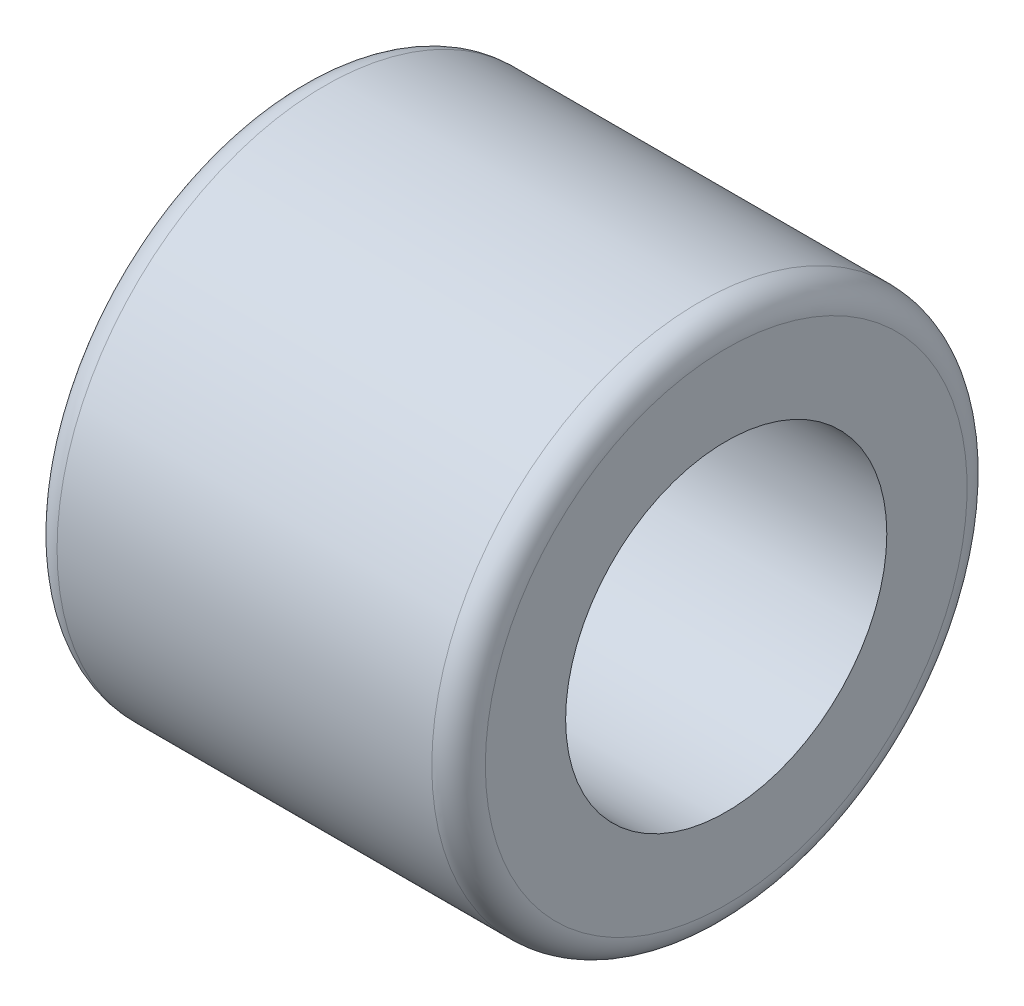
ISO-10303-21;
HEADER;
FILE_DESCRIPTION(('STEP AP214'),'2;1');
FILE_NAME('part.step','',(''),(''),'','','');
FILE_SCHEMA(('AUTOMOTIVE_DESIGN { 1 0 10303 214 1 1 1 1 }'));
ENDSEC;
DATA;
#1=APPLICATION_CONTEXT('core data for automotive mechanical design processes');
#2=APPLICATION_PROTOCOL_DEFINITION('international standard','automotive_design',2000,#1);
#3=PRODUCT_CONTEXT('',#1,'mechanical');
#4=PRODUCT('Part','Part','',(#3));
#5=PRODUCT_RELATED_PRODUCT_CATEGORY('part','',(#4));
#6=PRODUCT_DEFINITION_FORMATION('','',#4);
#7=PRODUCT_DEFINITION_CONTEXT('part definition',#1,'design');
#8=PRODUCT_DEFINITION('design','',#6,#7);
#9=PRODUCT_DEFINITION_SHAPE('','',#8);
#10=(LENGTH_UNIT() NAMED_UNIT(*) SI_UNIT(.MILLI.,.METRE.));
#11=(NAMED_UNIT(*) PLANE_ANGLE_UNIT() SI_UNIT($,.RADIAN.));
#12=(NAMED_UNIT(*) SI_UNIT($,.STERADIAN.) SOLID_ANGLE_UNIT());
#13=UNCERTAINTY_MEASURE_WITH_UNIT(LENGTH_MEASURE(1.E-05),#10,'distance_accuracy_value','');
#14=(GEOMETRIC_REPRESENTATION_CONTEXT(3) GLOBAL_UNCERTAINTY_ASSIGNED_CONTEXT((#13)) GLOBAL_UNIT_ASSIGNED_CONTEXT((#10,
#11,#12)) REPRESENTATION_CONTEXT('',''));
#15=CARTESIAN_POINT('',(0.,0.,0.));
#16=DIRECTION('',(0.,0.,1.));
#17=DIRECTION('',(1.,0.,0.));
#18=AXIS2_PLACEMENT_3D('',#15,#16,#17);
#19=CARTESIAN_POINT('',(-4.,5.,0.));
#20=DIRECTION('',(1.,0.,0.));
#21=DIRECTION('',(0.,0.,-1.));
#22=AXIS2_PLACEMENT_3D('',#19,#20,#21);
#23=PLANE('',#22);
#24=CARTESIAN_POINT('',(-4.,0.,0.));
#25=DIRECTION('',(1.,0.,0.));
#26=DIRECTION('',(0.,0.,-1.));
#27=AXIS2_PLACEMENT_3D('',#24,#25,#26);
#28=CIRCLE('',#27,4.5);
#29=CARTESIAN_POINT('',(-4.,0.,-4.5));
#30=VERTEX_POINT('',#29);
#31=EDGE_CURVE('E10',#30,#30,#28,.F.);
#32=ORIENTED_EDGE('',*,*,#31,.T.);
#33=EDGE_LOOP('',(#32));
#34=FACE_BOUND('',#33,.T.);
#35=CARTESIAN_POINT('',(-4.,0.,0.));
#36=DIRECTION('',(-1.,0.,0.));
#37=DIRECTION('',(0.,0.,1.));
#38=AXIS2_PLACEMENT_3D('',#35,#36,#37);
#39=CIRCLE('',#38,3.);
#40=CARTESIAN_POINT('',(-4.,0.,3.));
#41=VERTEX_POINT('',#40);
#42=EDGE_CURVE('E34',#41,#41,#39,.T.);
#43=ORIENTED_EDGE('',*,*,#42,.F.);
#44=EDGE_LOOP('',(#43));
#45=FACE_BOUND('',#44,.T.);
#46=ADVANCED_FACE('F15',(#34,#45),#23,.F.);
#47=CARTESIAN_POINT('',(-35.5169491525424,0.,0.));
#48=DIRECTION('',(-1.,0.,0.));
#49=DIRECTION('',(0.,0.,1.));
#50=AXIS2_PLACEMENT_3D('',#47,#48,#49);
#51=CYLINDRICAL_SURFACE('',#50,3.);
#52=CARTESIAN_POINT('',(4.,0.,0.));
#53=DIRECTION('',(-1.,0.,0.));
#54=DIRECTION('',(0.,0.,1.));
#55=AXIS2_PLACEMENT_3D('',#52,#53,#54);
#56=CIRCLE('',#55,3.);
#57=CARTESIAN_POINT('',(4.,0.,3.));
#58=VERTEX_POINT('',#57);
#59=EDGE_CURVE('E37',#58,#58,#56,.T.);
#60=ORIENTED_EDGE('',*,*,#59,.F.);
#61=EDGE_LOOP('',(#60));
#62=FACE_BOUND('',#61,.T.);
#63=ORIENTED_EDGE('',*,*,#42,.T.);
#64=EDGE_LOOP('',(#63));
#65=FACE_BOUND('',#64,.T.);
#66=ADVANCED_FACE('F43',(#62,#65),#51,.F.);
#67=CARTESIAN_POINT('',(4.,5.,0.));
#68=DIRECTION('',(-1.,0.,0.));
#69=DIRECTION('',(0.,0.,1.));
#70=AXIS2_PLACEMENT_3D('',#67,#68,#69);
#71=PLANE('',#70);
#72=CARTESIAN_POINT('',(4.,0.,0.));
#73=DIRECTION('',(-1.,0.,0.));
#74=DIRECTION('',(0.,0.,1.));
#75=AXIS2_PLACEMENT_3D('',#72,#73,#74);
#76=CIRCLE('',#75,4.5);
#77=CARTESIAN_POINT('',(4.,0.,4.5));
#78=VERTEX_POINT('',#77);
#79=EDGE_CURVE('E21',#78,#78,#76,.F.);
#80=ORIENTED_EDGE('',*,*,#79,.T.);
#81=EDGE_LOOP('',(#80));
#82=FACE_BOUND('',#81,.T.);
#83=ORIENTED_EDGE('',*,*,#59,.T.);
#84=EDGE_LOOP('',(#83));
#85=FACE_BOUND('',#84,.T.);
#86=ADVANCED_FACE('F41',(#82,#85),#71,.F.);
#87=CARTESIAN_POINT('',(-35.5169491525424,0.,0.));
#88=DIRECTION('',(-1.,0.,0.));
#89=DIRECTION('',(0.,0.,1.));
#90=AXIS2_PLACEMENT_3D('',#87,#88,#89);
#91=CYLINDRICAL_SURFACE('',#90,5.);
#92=CARTESIAN_POINT('',(3.5,0.,0.));
#93=DIRECTION('',(-1.,0.,0.));
#94=DIRECTION('',(0.,0.,1.));
#95=AXIS2_PLACEMENT_3D('',#92,#93,#94);
#96=CIRCLE('',#95,5.);
#97=CARTESIAN_POINT('',(3.5,0.,5.));
#98=VERTEX_POINT('',#97);
#99=EDGE_CURVE('E25',#98,#98,#96,.T.);
#100=ORIENTED_EDGE('',*,*,#99,.T.);
#101=EDGE_LOOP('',(#100));
#102=FACE_BOUND('',#101,.T.);
#103=CARTESIAN_POINT('',(-3.5,0.,0.));
#104=DIRECTION('',(1.,0.,0.));
#105=DIRECTION('',(0.,0.,-1.));
#106=AXIS2_PLACEMENT_3D('',#103,#104,#105);
#107=CIRCLE('',#106,5.);
#108=CARTESIAN_POINT('',(-3.5,0.,-5.));
#109=VERTEX_POINT('',#108);
#110=EDGE_CURVE('E29',#109,#109,#107,.T.);
#111=ORIENTED_EDGE('',*,*,#110,.T.);
#112=EDGE_LOOP('',(#111));
#113=FACE_BOUND('',#112,.T.);
#114=ADVANCED_FACE('F65',(#102,#113),#91,.T.);
#115=CARTESIAN_POINT('',(3.5,0.,0.));
#116=DIRECTION('',(-1.,0.,0.));
#117=DIRECTION('',(0.,0.,1.));
#118=AXIS2_PLACEMENT_3D('',#115,#116,#117);
#119=TOROIDAL_SURFACE('',#118,4.5,0.5);
#120=ORIENTED_EDGE('',*,*,#79,.F.);
#121=EDGE_LOOP('',(#120));
#122=FACE_BOUND('',#121,.T.);
#123=ORIENTED_EDGE('',*,*,#99,.F.);
#124=EDGE_LOOP('',(#123));
#125=FACE_BOUND('',#124,.T.);
#126=ADVANCED_FACE('F72',(#122,#125),#119,.T.);
#127=CARTESIAN_POINT('',(-3.5,0.,0.));
#128=DIRECTION('',(1.,0.,0.));
#129=DIRECTION('',(0.,0.,-1.));
#130=AXIS2_PLACEMENT_3D('',#127,#128,#129);
#131=TOROIDAL_SURFACE('',#130,4.5,0.5);
#132=ORIENTED_EDGE('',*,*,#110,.F.);
#133=EDGE_LOOP('',(#132));
#134=FACE_BOUND('',#133,.T.);
#135=ORIENTED_EDGE('',*,*,#31,.F.);
#136=EDGE_LOOP('',(#135));
#137=FACE_BOUND('',#136,.T.);
#138=ADVANCED_FACE('F80',(#134,#137),#131,.T.);
#139=CLOSED_SHELL('',(#46,#66,#86,#114,#126,#138));
#140=MANIFOLD_SOLID_BREP('B1',#139);
#141=ADVANCED_BREP_SHAPE_REPRESENTATION('',(#18,#140),#14);
#142=SHAPE_DEFINITION_REPRESENTATION(#9,#141);
ENDSEC;
END-ISO-10303-21;
